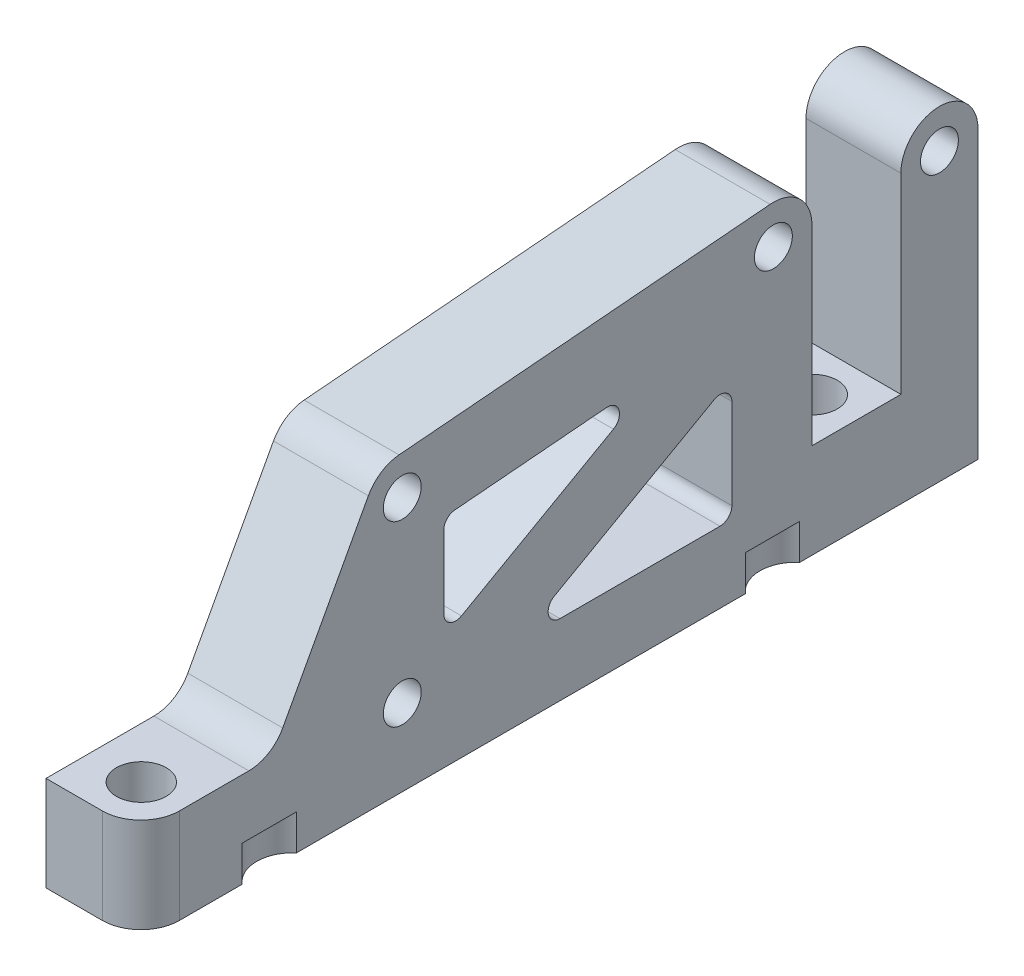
ISO-10303-21;
HEADER;
FILE_DESCRIPTION(('STEP AP214'),'2;1');
FILE_NAME('part.step','',(''),(''),'','','');
FILE_SCHEMA(('AUTOMOTIVE_DESIGN { 1 0 10303 214 1 1 1 1 }'));
ENDSEC;
DATA;
#1=APPLICATION_CONTEXT('core data for automotive mechanical design processes');
#2=APPLICATION_PROTOCOL_DEFINITION('international standard','automotive_design',2000,#1);
#3=PRODUCT_CONTEXT('',#1,'mechanical');
#4=PRODUCT('Part','Part','',(#3));
#5=PRODUCT_RELATED_PRODUCT_CATEGORY('part','',(#4));
#6=PRODUCT_DEFINITION_FORMATION('','',#4);
#7=PRODUCT_DEFINITION_CONTEXT('part definition',#1,'design');
#8=PRODUCT_DEFINITION('design','',#6,#7);
#9=PRODUCT_DEFINITION_SHAPE('','',#8);
#10=(LENGTH_UNIT() NAMED_UNIT(*) SI_UNIT(.MILLI.,.METRE.));
#11=(NAMED_UNIT(*) PLANE_ANGLE_UNIT() SI_UNIT($,.RADIAN.));
#12=(NAMED_UNIT(*) SI_UNIT($,.STERADIAN.) SOLID_ANGLE_UNIT());
#13=UNCERTAINTY_MEASURE_WITH_UNIT(LENGTH_MEASURE(1.E-05),#10,'distance_accuracy_value','');
#14=(GEOMETRIC_REPRESENTATION_CONTEXT(3) GLOBAL_UNCERTAINTY_ASSIGNED_CONTEXT((#13)) GLOBAL_UNIT_ASSIGNED_CONTEXT((#10,
#11,#12)) REPRESENTATION_CONTEXT('',''));
#15=CARTESIAN_POINT('',(0.,0.,0.));
#16=DIRECTION('',(0.,0.,1.));
#17=DIRECTION('',(1.,0.,0.));
#18=AXIS2_PLACEMENT_3D('',#15,#16,#17);
#19=CARTESIAN_POINT('',(32.0000000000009,140.15,654.715728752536));
#20=DIRECTION('',(-1.,0.,0.));
#21=DIRECTION('',(0.,0.,-1.));
#22=AXIS2_PLACEMENT_3D('',#19,#20,#21);
#23=PLANE('',#22);
#24=DIRECTION('',(0.,0.,1.));
#25=VECTOR('',#24,1.);
#26=CARTESIAN_POINT('',(32.0000000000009,122.,690.512606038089));
#27=LINE('',#26,#25);
#28=CARTESIAN_POINT('',(32.0000000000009,122.,673.215728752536));
#29=VERTEX_POINT('',#28);
#30=CARTESIAN_POINT('',(32.0000000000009,122.,686.705012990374));
#31=VERTEX_POINT('',#30);
#32=EDGE_CURVE('E454',#29,#31,#27,.T.);
#33=ORIENTED_EDGE('',*,*,#32,.T.);
#34=CARTESIAN_POINT('',(32.0000000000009,123.,686.705012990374));
#35=DIRECTION('',(1.,0.,0.));
#36=DIRECTION('',(0.,0.,-1.));
#37=AXIS2_PLACEMENT_3D('',#34,#35,#36);
#38=CIRCLE('',#37,1.);
#39=CARTESIAN_POINT('',(32.0000000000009,123.870949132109,687.196386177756));
#40=VERTEX_POINT('',#39);
#41=EDGE_CURVE('E437',#40,#31,#38,.T.);
#42=ORIENTED_EDGE('',*,*,#41,.F.);
#43=DIRECTION('',(0.,0.491373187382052,-0.870949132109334));
#44=VECTOR('',#43,1.);
#45=CARTESIAN_POINT('',(32.0000000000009,132.322755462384,672.215728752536));
#46=LINE('',#45,#44);
#47=CARTESIAN_POINT('',(32.0000000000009,131.481350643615,673.707101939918));
#48=VERTEX_POINT('',#47);
#49=EDGE_CURVE('E459',#40,#48,#46,.T.);
#50=ORIENTED_EDGE('',*,*,#49,.T.);
#51=CARTESIAN_POINT('',(32.0000000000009,130.610401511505,673.215728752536));
#52=DIRECTION('',(1.,0.,0.));
#53=DIRECTION('',(0.,0.,-1.));
#54=AXIS2_PLACEMENT_3D('',#51,#52,#53);
#55=CIRCLE('',#54,1.);
#56=CARTESIAN_POINT('',(32.0000000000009,130.610401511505,672.215728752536));
#57=VERTEX_POINT('',#56);
#58=EDGE_CURVE('E431',#57,#48,#55,.T.);
#59=ORIENTED_EDGE('',*,*,#58,.F.);
#60=DIRECTION('',(0.,-1.,0.));
#61=VECTOR('',#60,1.);
#62=CARTESIAN_POINT('',(32.0000000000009,122.,672.215728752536));
#63=LINE('',#62,#61);
#64=CARTESIAN_POINT('',(32.0000000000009,123.,672.215728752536));
#65=VERTEX_POINT('',#64);
#66=EDGE_CURVE('E449',#57,#65,#63,.T.);
#67=ORIENTED_EDGE('',*,*,#66,.T.);
#68=CARTESIAN_POINT('',(32.0000000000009,123.,673.215728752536));
#69=DIRECTION('',(1.,0.,0.));
#70=DIRECTION('',(0.,0.,-1.));
#71=AXIS2_PLACEMENT_3D('',#68,#69,#70);
#72=CIRCLE('',#71,1.);
#73=EDGE_CURVE('E49',#29,#65,#72,.T.);
#74=ORIENTED_EDGE('',*,*,#73,.F.);
#75=EDGE_LOOP('',(#33,#42,#50,#59,#67,#74));
#76=FACE_BOUND('',#75,.T.);
#77=DIRECTION('',(0.,1.,0.));
#78=VECTOR('',#77,1.);
#79=CARTESIAN_POINT('',(32.0000000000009,134.283940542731,696.500000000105));
#80=LINE('',#79,#78);
#81=CARTESIAN_POINT('',(32.0000000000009,127.223414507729,696.500000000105));
#82=VERTEX_POINT('',#81);
#83=CARTESIAN_POINT('',(32.0000000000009,133.365066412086,696.500000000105));
#84=VERTEX_POINT('',#83);
#85=EDGE_CURVE('E457',#82,#84,#80,.T.);
#86=ORIENTED_EDGE('',*,*,#85,.T.);
#87=CARTESIAN_POINT('',(32.0000000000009,133.365066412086,695.500000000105));
#88=DIRECTION('',(1.,0.,0.));
#89=DIRECTION('',(0.,0.,-1.));
#90=AXIS2_PLACEMENT_3D('',#87,#88,#89);
#91=CIRCLE('',#90,1.);
#92=CARTESIAN_POINT('',(32.0000000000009,134.36149795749,695.584404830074));
#93=VERTEX_POINT('',#92);
#94=EDGE_CURVE('E419',#93,#84,#91,.T.);
#95=ORIENTED_EDGE('',*,*,#94,.F.);
#96=DIRECTION('',(0.,0.0844048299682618,-0.996431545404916));
#97=VECTOR('',#96,1.);
#98=CARTESIAN_POINT('',(32.0000000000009,135.833816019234,678.203122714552));
#99=LINE('',#98,#97);
#100=CARTESIAN_POINT('',(32.0000000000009,135.446523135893,682.775264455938));
#101=VERTEX_POINT('',#100);
#102=EDGE_CURVE('E474',#93,#101,#99,.T.);
#103=ORIENTED_EDGE('',*,*,#102,.T.);
#104=CARTESIAN_POINT('',(32.0000000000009,134.450091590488,682.69085962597));
#105=DIRECTION('',(1.,0.,0.));
#106=DIRECTION('',(0.,0.,-1.));
#107=AXIS2_PLACEMENT_3D('',#104,#105,#106);
#108=CIRCLE('',#107,1.);
#109=CARTESIAN_POINT('',(32.0000000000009,133.579142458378,682.199486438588));
#110=VERTEX_POINT('',#109);
#111=EDGE_CURVE('E413',#110,#101,#108,.T.);
#112=ORIENTED_EDGE('',*,*,#111,.F.);
#113=DIRECTION('',(0.,-0.49137318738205,0.870949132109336));
#114=VECTOR('',#113,1.);
#115=CARTESIAN_POINT('',(32.0000000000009,125.51106055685,696.500000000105));
#116=LINE('',#115,#114);
#117=CARTESIAN_POINT('',(32.0000000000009,126.35246537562,695.008626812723));
#118=VERTEX_POINT('',#117);
#119=EDGE_CURVE('E453',#110,#118,#116,.T.);
#120=ORIENTED_EDGE('',*,*,#119,.T.);
#121=CARTESIAN_POINT('',(32.0000000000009,127.223414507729,695.500000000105));
#122=DIRECTION('',(1.,0.,0.));
#123=DIRECTION('',(0.,0.,-1.));
#124=AXIS2_PLACEMENT_3D('',#121,#122,#123);
#125=CIRCLE('',#124,1.);
#126=EDGE_CURVE('E425',#82,#118,#125,.T.);
#127=ORIENTED_EDGE('',*,*,#126,.F.);
#128=EDGE_LOOP('',(#86,#95,#103,#112,#120,#127));
#129=FACE_BOUND('',#128,.T.);
#130=DIRECTION('',(0.,0.,1.));
#131=VECTOR('',#130,1.);
#132=CARTESIAN_POINT('',(32.0000000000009,116.,651.465728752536));
#133=LINE('',#132,#131);
#134=CARTESIAN_POINT('',(32.0000000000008,116.,713.50056694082));
#135=VERTEX_POINT('',#134);
#136=CARTESIAN_POINT('',(32.0000000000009,116.,718.78427124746));
#137=VERTEX_POINT('',#136);
#138=EDGE_CURVE('E243',#135,#137,#133,.T.);
#139=ORIENTED_EDGE('',*,*,#138,.F.);
#140=DIRECTION('',(0.,1.,0.));
#141=VECTOR('',#140,1.);
#142=CARTESIAN_POINT('',(32.0000000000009,116.,713.50056694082));
#143=LINE('',#142,#141);
#144=CARTESIAN_POINT('',(32.0000000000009,119.,713.50056694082));
#145=VERTEX_POINT('',#144);
#146=EDGE_CURVE('E253',#145,#135,#143,.F.);
#147=ORIENTED_EDGE('',*,*,#146,.F.);
#148=DIRECTION('',(0.,0.,1.));
#149=VECTOR('',#148,1.);
#150=CARTESIAN_POINT('',(32.0000000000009,119.,654.715728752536));
#151=LINE('',#150,#149);
#152=CARTESIAN_POINT('',(32.0000000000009,119.,708.925839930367));
#153=VERTEX_POINT('',#152);
#154=EDGE_CURVE('E351',#153,#145,#151,.T.);
#155=ORIENTED_EDGE('',*,*,#154,.F.);
#156=DIRECTION('',(0.,1.,0.));
#157=VECTOR('',#156,1.);
#158=CARTESIAN_POINT('',(32.0000000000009,116.,708.925839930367));
#159=LINE('',#158,#157);
#160=CARTESIAN_POINT('',(32.0000000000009,116.,708.925839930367));
#161=VERTEX_POINT('',#160);
#162=EDGE_CURVE('E258',#161,#153,#159,.T.);
#163=ORIENTED_EDGE('',*,*,#162,.F.);
#164=CARTESIAN_POINT('',(32.0000000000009,116.,671.074160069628));
#165=VERTEX_POINT('',#164);
#166=EDGE_CURVE('E245',#165,#161,#133,.T.);
#167=ORIENTED_EDGE('',*,*,#166,.F.);
#168=DIRECTION('',(0.,1.,0.));
#169=VECTOR('',#168,1.);
#170=CARTESIAN_POINT('',(32.0000000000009,116.,671.074160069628));
#171=LINE('',#170,#169);
#172=CARTESIAN_POINT('',(32.0000000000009,119.,671.074160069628));
#173=VERTEX_POINT('',#172);
#174=EDGE_CURVE('E488',#173,#165,#171,.F.);
#175=ORIENTED_EDGE('',*,*,#174,.F.);
#176=DIRECTION('',(0.,0.,1.));
#177=VECTOR('',#176,1.);
#178=CARTESIAN_POINT('',(32.0000000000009,119.,654.715728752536));
#179=LINE('',#178,#177);
#180=CARTESIAN_POINT('',(32.0000000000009,119.,666.499433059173));
#181=VERTEX_POINT('',#180);
#182=EDGE_CURVE('E361',#181,#173,#179,.T.);
#183=ORIENTED_EDGE('',*,*,#182,.F.);
#184=DIRECTION('',(0.,1.,0.));
#185=VECTOR('',#184,1.);
#186=CARTESIAN_POINT('',(32.0000000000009,116.,666.499433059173));
#187=LINE('',#186,#185);
#188=CARTESIAN_POINT('',(32.0000000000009,116.,666.499433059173));
#189=VERTEX_POINT('',#188);
#190=EDGE_CURVE('E491',#189,#181,#187,.T.);
#191=ORIENTED_EDGE('',*,*,#190,.F.);
#192=CARTESIAN_POINT('',(32.0000000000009,116.,651.465728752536));
#193=VERTEX_POINT('',#192);
#194=EDGE_CURVE('E268',#193,#189,#133,.T.);
#195=ORIENTED_EDGE('',*,*,#194,.F.);
#196=DIRECTION('',(0.,-1.,0.));
#197=VECTOR('',#196,1.);
#198=CARTESIAN_POINT('',(32.0000000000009,140.15,651.465728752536));
#199=LINE('',#198,#197);
#200=CARTESIAN_POINT('',(32.0000000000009,140.15,651.465728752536));
#201=VERTEX_POINT('',#200);
#202=EDGE_CURVE('E266',#201,#193,#199,.T.);
#203=ORIENTED_EDGE('',*,*,#202,.F.);
#204=CARTESIAN_POINT('',(32.0000000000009,140.15,654.715728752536));
#205=DIRECTION('',(-1.,0.,0.));
#206=DIRECTION('',(0.,0.,-1.));
#207=AXIS2_PLACEMENT_3D('',#204,#205,#206);
#208=CIRCLE('',#207,3.24999999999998);
#209=CARTESIAN_POINT('',(32.0000000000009,140.15,657.965728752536));
#210=VERTEX_POINT('',#209);
#211=EDGE_CURVE('E270',#210,#201,#208,.T.);
#212=ORIENTED_EDGE('',*,*,#211,.F.);
#213=DIRECTION('',(0.,1.,0.));
#214=VECTOR('',#213,1.);
#215=CARTESIAN_POINT('',(32.0000000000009,140.15,657.965728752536));
#216=LINE('',#215,#214);
#217=CARTESIAN_POINT('',(32.0000000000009,124.,657.965728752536));
#218=VERTEX_POINT('',#217);
#219=EDGE_CURVE('E296',#218,#210,#216,.T.);
#220=ORIENTED_EDGE('',*,*,#219,.F.);
#221=DIRECTION('',(0.,0.,-1.));
#222=VECTOR('',#221,1.);
#223=CARTESIAN_POINT('',(32.0000000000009,124.,657.965728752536));
#224=LINE('',#223,#222);
#225=CARTESIAN_POINT('',(32.0000000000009,124.,665.465728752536));
#226=VERTEX_POINT('',#225);
#227=EDGE_CURVE('E293',#226,#218,#224,.T.);
#228=ORIENTED_EDGE('',*,*,#227,.F.);
#229=DIRECTION('',(0.,-1.,0.));
#230=VECTOR('',#229,1.);
#231=CARTESIAN_POINT('',(32.0000000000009,124.,665.465728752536));
#232=LINE('',#231,#230);
#233=CARTESIAN_POINT('',(32.0000000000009,140.15,665.465728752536));
#234=VERTEX_POINT('',#233);
#235=EDGE_CURVE('E290',#234,#226,#232,.T.);
#236=ORIENTED_EDGE('',*,*,#235,.F.);
#237=CARTESIAN_POINT('',(32.0000000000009,140.15,668.715728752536));
#238=DIRECTION('',(-1.,0.,0.));
#239=DIRECTION('',(0.,0.,-1.));
#240=AXIS2_PLACEMENT_3D('',#237,#238,#239);
#241=CIRCLE('',#240,3.24999999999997);
#242=CARTESIAN_POINT('',(32.0000000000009,143.388402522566,668.990044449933));
#243=VERTEX_POINT('',#242);
#244=EDGE_CURVE('E287',#243,#234,#241,.T.);
#245=ORIENTED_EDGE('',*,*,#244,.F.);
#246=DIRECTION('',(0.,0.0844048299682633,-0.996431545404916));
#247=VECTOR('',#246,1.);
#248=CARTESIAN_POINT('',(32.0000000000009,143.388402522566,668.990044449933));
#249=LINE('',#248,#247);
#250=CARTESIAN_POINT('',(32.0000000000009,140.738402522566,700.274315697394));
#251=VERTEX_POINT('',#250);
#252=EDGE_CURVE('E282',#251,#243,#249,.T.);
#253=ORIENTED_EDGE('',*,*,#252,.F.);
#254=CARTESIAN_POINT('',(32.0000000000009,137.5,699.999999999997));
#255=DIRECTION('',(1.,0.,0.));
#256=DIRECTION('',(0.,0.,-1.));
#257=AXIS2_PLACEMENT_3D('',#254,#255,#256);
#258=CIRCLE('',#257,3.25);
#259=CARTESIAN_POINT('',(32.0000000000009,139.046648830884,702.858387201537));
#260=VERTEX_POINT('',#259);
#261=EDGE_CURVE('E375',#260,#251,#258,.F.);
#262=ORIENTED_EDGE('',*,*,#261,.F.);
#263=DIRECTION('',(0.,0.87950375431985,-0.475891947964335));
#264=VECTOR('',#263,1.);
#265=CARTESIAN_POINT('',(32.0000000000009,124.,710.999999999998));
#266=LINE('',#265,#264);
#267=CARTESIAN_POINT('',(32.0000000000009,125.703351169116,710.078331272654));
#268=VERTEX_POINT('',#267);
#269=EDGE_CURVE('E278',#268,#260,#266,.T.);
#270=ORIENTED_EDGE('',*,*,#269,.F.);
#271=CARTESIAN_POINT('',(32.0000000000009,127.25,712.936718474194));
#272=DIRECTION('',(1.,0.,0.));
#273=DIRECTION('',(0.,0.,-1.));
#274=AXIS2_PLACEMENT_3D('',#271,#272,#273);
#275=CIRCLE('',#274,3.25);
#276=CARTESIAN_POINT('',(32.0000000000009,124.,712.936718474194));
#277=VERTEX_POINT('',#276);
#278=EDGE_CURVE('E381',#277,#268,#275,.T.);
#279=ORIENTED_EDGE('',*,*,#278,.F.);
#280=DIRECTION('',(0.,0.,-1.));
#281=VECTOR('',#280,1.);
#282=CARTESIAN_POINT('',(32.0000000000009,124.,710.999999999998));
#283=LINE('',#282,#281);
#284=CARTESIAN_POINT('',(32.0000000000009,124.,718.78427124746));
#285=VERTEX_POINT('',#284);
#286=EDGE_CURVE('E274',#285,#277,#283,.T.);
#287=ORIENTED_EDGE('',*,*,#286,.F.);
#288=DIRECTION('',(0.,1.,0.));
#289=VECTOR('',#288,1.);
#290=CARTESIAN_POINT('',(32.0000000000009,140.15,718.78427124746));
#291=LINE('',#290,#289);
#292=EDGE_CURVE('E265',#137,#285,#291,.T.);
#293=ORIENTED_EDGE('',*,*,#292,.F.);
#294=EDGE_LOOP('',(#139,#147,#155,#163,#167,#175,#183,#191,#195,#203,#212,#220,#228,#236,#245,
#253,#262,#270,#279,#287,#293));
#295=FACE_BOUND('',#294,.T.);
#296=CARTESIAN_POINT('',(32.0000000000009,140.15,654.715728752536));
#297=DIRECTION('',(-1.,0.,0.));
#298=DIRECTION('',(0.,0.,1.));
#299=AXIS2_PLACEMENT_3D('',#296,#297,#298);
#300=CIRCLE('',#299,1.60000000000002);
#301=CARTESIAN_POINT('',(32.0000000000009,140.15,656.315728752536));
#302=VERTEX_POINT('',#301);
#303=EDGE_CURVE('E304',#302,#302,#300,.T.);
#304=ORIENTED_EDGE('',*,*,#303,.T.);
#305=EDGE_LOOP('',(#304));
#306=FACE_BOUND('',#305,.T.);
#307=CARTESIAN_POINT('',(32.0000000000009,140.15,668.715728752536));
#308=DIRECTION('',(-1.,0.,0.));
#309=DIRECTION('',(0.,0.,1.));
#310=AXIS2_PLACEMENT_3D('',#307,#308,#309);
#311=CIRCLE('',#310,1.60000000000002);
#312=CARTESIAN_POINT('',(32.0000000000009,140.15,670.315728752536));
#313=VERTEX_POINT('',#312);
#314=EDGE_CURVE('E511',#313,#313,#311,.T.);
#315=ORIENTED_EDGE('',*,*,#314,.T.);
#316=EDGE_LOOP('',(#315));
#317=FACE_BOUND('',#316,.T.);
#318=CARTESIAN_POINT('',(32.0000000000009,137.5,699.999999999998));
#319=DIRECTION('',(-1.,0.,0.));
#320=DIRECTION('',(0.,0.,1.));
#321=AXIS2_PLACEMENT_3D('',#318,#319,#320);
#322=CIRCLE('',#321,1.60000000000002);
#323=CARTESIAN_POINT('',(32.0000000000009,137.5,701.599999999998));
#324=VERTEX_POINT('',#323);
#325=EDGE_CURVE('E505',#324,#324,#322,.T.);
#326=ORIENTED_EDGE('',*,*,#325,.T.);
#327=EDGE_LOOP('',(#326));
#328=FACE_BOUND('',#327,.T.);
#329=CARTESIAN_POINT('',(32.0000000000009,122.5,699.999999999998));
#330=DIRECTION('',(-1.,0.,0.));
#331=DIRECTION('',(0.,0.,1.));
#332=AXIS2_PLACEMENT_3D('',#329,#330,#331);
#333=CIRCLE('',#332,1.60000000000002);
#334=CARTESIAN_POINT('',(32.0000000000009,122.5,701.599999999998));
#335=VERTEX_POINT('',#334);
#336=EDGE_CURVE('E499',#335,#335,#333,.T.);
#337=ORIENTED_EDGE('',*,*,#336,.T.);
#338=EDGE_LOOP('',(#337));
#339=FACE_BOUND('',#338,.T.);
#340=ADVANCED_FACE('F41',(#76,#129,#295,#306,#317,#328,#339),#23,.F.);
#341=CARTESIAN_POINT('',(24.0000000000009,140.15,654.715728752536));
#342=DIRECTION('',(-1.,0.,0.));
#343=DIRECTION('',(0.,0.,-1.));
#344=AXIS2_PLACEMENT_3D('',#341,#342,#343);
#345=PLANE('',#344);
#346=DIRECTION('',(0.,0.491373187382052,-0.870949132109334));
#347=VECTOR('',#346,1.);
#348=CARTESIAN_POINT('',(24.0000000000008,132.322755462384,672.215728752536));
#349=LINE('',#348,#347);
#350=CARTESIAN_POINT('',(24.0000000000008,123.870949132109,687.196386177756));
#351=VERTEX_POINT('',#350);
#352=CARTESIAN_POINT('',(24.0000000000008,131.481350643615,673.707101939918));
#353=VERTEX_POINT('',#352);
#354=EDGE_CURVE('E463',#351,#353,#349,.T.);
#355=ORIENTED_EDGE('',*,*,#354,.F.);
#356=CARTESIAN_POINT('',(24.0000000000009,123.,686.705012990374));
#357=DIRECTION('',(1.,0.,0.));
#358=DIRECTION('',(0.,0.,-1.));
#359=AXIS2_PLACEMENT_3D('',#356,#357,#358);
#360=CIRCLE('',#359,1.);
#361=CARTESIAN_POINT('',(24.0000000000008,122.,686.705012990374));
#362=VERTEX_POINT('',#361);
#363=EDGE_CURVE('E439',#362,#351,#360,.F.);
#364=ORIENTED_EDGE('',*,*,#363,.F.);
#365=DIRECTION('',(0.,0.,1.));
#366=VECTOR('',#365,1.);
#367=CARTESIAN_POINT('',(24.0000000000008,122.,690.512606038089));
#368=LINE('',#367,#366);
#369=CARTESIAN_POINT('',(24.0000000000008,122.,673.215728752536));
#370=VERTEX_POINT('',#369);
#371=EDGE_CURVE('E466',#370,#362,#368,.T.);
#372=ORIENTED_EDGE('',*,*,#371,.F.);
#373=CARTESIAN_POINT('',(24.0000000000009,123.,673.215728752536));
#374=DIRECTION('',(1.,0.,0.));
#375=DIRECTION('',(0.,0.,-1.));
#376=AXIS2_PLACEMENT_3D('',#373,#374,#375);
#377=CIRCLE('',#376,1.);
#378=CARTESIAN_POINT('',(24.0000000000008,123.,672.215728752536));
#379=VERTEX_POINT('',#378);
#380=EDGE_CURVE('E11',#379,#370,#377,.F.);
#381=ORIENTED_EDGE('',*,*,#380,.F.);
#382=DIRECTION('',(0.,-1.,0.));
#383=VECTOR('',#382,1.);
#384=CARTESIAN_POINT('',(24.0000000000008,122.,672.215728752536));
#385=LINE('',#384,#383);
#386=CARTESIAN_POINT('',(24.0000000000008,130.610401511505,672.215728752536));
#387=VERTEX_POINT('',#386);
#388=EDGE_CURVE('E468',#387,#379,#385,.T.);
#389=ORIENTED_EDGE('',*,*,#388,.F.);
#390=CARTESIAN_POINT('',(24.0000000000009,130.610401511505,673.215728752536));
#391=DIRECTION('',(1.,0.,0.));
#392=DIRECTION('',(0.,0.,-1.));
#393=AXIS2_PLACEMENT_3D('',#390,#391,#392);
#394=CIRCLE('',#393,1.);
#395=EDGE_CURVE('E434',#353,#387,#394,.F.);
#396=ORIENTED_EDGE('',*,*,#395,.F.);
#397=EDGE_LOOP('',(#355,#364,#372,#381,#389,#396));
#398=FACE_BOUND('',#397,.T.);
#399=DIRECTION('',(0.,0.0844048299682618,-0.996431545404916));
#400=VECTOR('',#399,1.);
#401=CARTESIAN_POINT('',(24.0000000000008,135.833816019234,678.203122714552));
#402=LINE('',#401,#400);
#403=CARTESIAN_POINT('',(24.0000000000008,134.36149795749,695.584404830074));
#404=VERTEX_POINT('',#403);
#405=CARTESIAN_POINT('',(24.0000000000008,135.446523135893,682.775264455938));
#406=VERTEX_POINT('',#405);
#407=EDGE_CURVE('E250',#404,#406,#402,.T.);
#408=ORIENTED_EDGE('',*,*,#407,.F.);
#409=CARTESIAN_POINT('',(24.0000000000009,133.365066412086,695.500000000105));
#410=DIRECTION('',(1.,0.,0.));
#411=DIRECTION('',(0.,0.,-1.));
#412=AXIS2_PLACEMENT_3D('',#409,#410,#411);
#413=CIRCLE('',#412,1.);
#414=CARTESIAN_POINT('',(24.0000000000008,133.365066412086,696.500000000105));
#415=VERTEX_POINT('',#414);
#416=EDGE_CURVE('E422',#415,#404,#413,.F.);
#417=ORIENTED_EDGE('',*,*,#416,.F.);
#418=DIRECTION('',(0.,1.,0.));
#419=VECTOR('',#418,1.);
#420=CARTESIAN_POINT('',(24.0000000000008,134.283940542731,696.500000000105));
#421=LINE('',#420,#419);
#422=CARTESIAN_POINT('',(24.0000000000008,127.223414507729,696.500000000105));
#423=VERTEX_POINT('',#422);
#424=EDGE_CURVE('E473',#423,#415,#421,.T.);
#425=ORIENTED_EDGE('',*,*,#424,.F.);
#426=CARTESIAN_POINT('',(24.0000000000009,127.223414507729,695.500000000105));
#427=DIRECTION('',(1.,0.,0.));
#428=DIRECTION('',(0.,0.,-1.));
#429=AXIS2_PLACEMENT_3D('',#426,#427,#428);
#430=CIRCLE('',#429,1.);
#431=CARTESIAN_POINT('',(24.0000000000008,126.35246537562,695.008626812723));
#432=VERTEX_POINT('',#431);
#433=EDGE_CURVE('E428',#432,#423,#430,.F.);
#434=ORIENTED_EDGE('',*,*,#433,.F.);
#435=DIRECTION('',(0.,-0.49137318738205,0.870949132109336));
#436=VECTOR('',#435,1.);
#437=CARTESIAN_POINT('',(24.0000000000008,125.51106055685,696.500000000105));
#438=LINE('',#437,#436);
#439=CARTESIAN_POINT('',(24.0000000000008,133.579142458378,682.199486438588));
#440=VERTEX_POINT('',#439);
#441=EDGE_CURVE('E470',#440,#432,#438,.T.);
#442=ORIENTED_EDGE('',*,*,#441,.F.);
#443=CARTESIAN_POINT('',(24.0000000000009,134.450091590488,682.69085962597));
#444=DIRECTION('',(1.,0.,0.));
#445=DIRECTION('',(0.,0.,-1.));
#446=AXIS2_PLACEMENT_3D('',#443,#444,#445);
#447=CIRCLE('',#446,1.);
#448=EDGE_CURVE('E416',#406,#440,#447,.F.);
#449=ORIENTED_EDGE('',*,*,#448,.F.);
#450=EDGE_LOOP('',(#408,#417,#425,#434,#442,#449));
#451=FACE_BOUND('',#450,.T.);
#452=CARTESIAN_POINT('',(24.0000000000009,137.5,699.999999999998));
#453=DIRECTION('',(-1.,0.,0.));
#454=DIRECTION('',(0.,0.,1.));
#455=AXIS2_PLACEMENT_3D('',#452,#453,#454);
#456=CIRCLE('',#455,1.60000000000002);
#457=CARTESIAN_POINT('',(24.0000000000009,137.5,701.599999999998));
#458=VERTEX_POINT('',#457);
#459=EDGE_CURVE('E502',#458,#458,#456,.T.);
#460=ORIENTED_EDGE('',*,*,#459,.F.);
#461=EDGE_LOOP('',(#460));
#462=FACE_BOUND('',#461,.T.);
#463=CARTESIAN_POINT('',(24.0000000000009,140.15,654.715728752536));
#464=DIRECTION('',(-1.,0.,0.));
#465=DIRECTION('',(0.,0.,1.));
#466=AXIS2_PLACEMENT_3D('',#463,#464,#465);
#467=CIRCLE('',#466,1.60000000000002);
#468=CARTESIAN_POINT('',(24.0000000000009,140.15,656.315728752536));
#469=VERTEX_POINT('',#468);
#470=EDGE_CURVE('E514',#469,#469,#467,.T.);
#471=ORIENTED_EDGE('',*,*,#470,.F.);
#472=EDGE_LOOP('',(#471));
#473=FACE_BOUND('',#472,.T.);
#474=DIRECTION('',(0.,0.0844048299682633,-0.996431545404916));
#475=VECTOR('',#474,1.);
#476=CARTESIAN_POINT('',(24.0000000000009,143.388402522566,668.990044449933));
#477=LINE('',#476,#475);
#478=CARTESIAN_POINT('',(24.0000000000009,140.738402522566,700.274315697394));
#479=VERTEX_POINT('',#478);
#480=CARTESIAN_POINT('',(24.0000000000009,143.388402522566,668.990044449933));
#481=VERTEX_POINT('',#480);
#482=EDGE_CURVE('E319',#479,#481,#477,.T.);
#483=ORIENTED_EDGE('',*,*,#482,.T.);
#484=CARTESIAN_POINT('',(24.0000000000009,140.15,668.715728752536));
#485=DIRECTION('',(-1.,0.,0.));
#486=DIRECTION('',(0.,0.,-1.));
#487=AXIS2_PLACEMENT_3D('',#484,#485,#486);
#488=CIRCLE('',#487,3.24999999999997);
#489=CARTESIAN_POINT('',(24.0000000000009,140.15,665.465728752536));
#490=VERTEX_POINT('',#489);
#491=EDGE_CURVE('E322',#481,#490,#488,.T.);
#492=ORIENTED_EDGE('',*,*,#491,.T.);
#493=DIRECTION('',(0.,-1.,0.));
#494=VECTOR('',#493,1.);
#495=CARTESIAN_POINT('',(24.0000000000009,124.,665.465728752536));
#496=LINE('',#495,#494);
#497=CARTESIAN_POINT('',(24.0000000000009,124.,665.465728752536));
#498=VERTEX_POINT('',#497);
#499=EDGE_CURVE('E325',#490,#498,#496,.T.);
#500=ORIENTED_EDGE('',*,*,#499,.T.);
#501=DIRECTION('',(0.,0.,-1.));
#502=VECTOR('',#501,1.);
#503=CARTESIAN_POINT('',(24.0000000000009,124.,657.965728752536));
#504=LINE('',#503,#502);
#505=CARTESIAN_POINT('',(24.0000000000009,124.,657.965728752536));
#506=VERTEX_POINT('',#505);
#507=EDGE_CURVE('E328',#498,#506,#504,.T.);
#508=ORIENTED_EDGE('',*,*,#507,.T.);
#509=DIRECTION('',(0.,1.,0.));
#510=VECTOR('',#509,1.);
#511=CARTESIAN_POINT('',(24.0000000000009,140.15,657.965728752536));
#512=LINE('',#511,#510);
#513=CARTESIAN_POINT('',(24.0000000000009,140.15,657.965728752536));
#514=VERTEX_POINT('',#513);
#515=EDGE_CURVE('E331',#506,#514,#512,.T.);
#516=ORIENTED_EDGE('',*,*,#515,.T.);
#517=CARTESIAN_POINT('',(24.0000000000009,140.15,654.715728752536));
#518=DIRECTION('',(-1.,0.,0.));
#519=DIRECTION('',(0.,0.,-1.));
#520=AXIS2_PLACEMENT_3D('',#517,#518,#519);
#521=CIRCLE('',#520,3.24999999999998);
#522=CARTESIAN_POINT('',(24.0000000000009,140.15,651.465728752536));
#523=VERTEX_POINT('',#522);
#524=EDGE_CURVE('E300',#514,#523,#521,.T.);
#525=ORIENTED_EDGE('',*,*,#524,.T.);
#526=DIRECTION('',(0.,-1.,0.));
#527=VECTOR('',#526,1.);
#528=CARTESIAN_POINT('',(24.0000000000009,140.15,651.465728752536));
#529=LINE('',#528,#527);
#530=CARTESIAN_POINT('',(24.0000000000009,116.,651.465728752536));
#531=VERTEX_POINT('',#530);
#532=EDGE_CURVE('E303',#523,#531,#529,.T.);
#533=ORIENTED_EDGE('',*,*,#532,.T.);
#534=DIRECTION('',(0.,0.,1.));
#535=VECTOR('',#534,1.);
#536=CARTESIAN_POINT('',(24.0000000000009,116.,651.465728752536));
#537=LINE('',#536,#535);
#538=CARTESIAN_POINT('',(24.0000000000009,116.,722.03427124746));
#539=VERTEX_POINT('',#538);
#540=EDGE_CURVE('E307',#531,#539,#537,.T.);
#541=ORIENTED_EDGE('',*,*,#540,.T.);
#542=DIRECTION('',(0.,1.,0.));
#543=VECTOR('',#542,1.);
#544=CARTESIAN_POINT('',(24.0000000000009,124.,722.03427124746));
#545=LINE('',#544,#543);
#546=CARTESIAN_POINT('',(24.0000000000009,124.,722.03427124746));
#547=VERTEX_POINT('',#546);
#548=EDGE_CURVE('E310',#539,#547,#545,.T.);
#549=ORIENTED_EDGE('',*,*,#548,.T.);
#550=DIRECTION('',(0.,0.,-1.));
#551=VECTOR('',#550,1.);
#552=CARTESIAN_POINT('',(24.0000000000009,124.,710.999999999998));
#553=LINE('',#552,#551);
#554=CARTESIAN_POINT('',(24.0000000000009,124.,712.936718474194));
#555=VERTEX_POINT('',#554);
#556=EDGE_CURVE('E313',#547,#555,#553,.T.);
#557=ORIENTED_EDGE('',*,*,#556,.T.);
#558=CARTESIAN_POINT('',(24.0000000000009,127.25,712.936718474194));
#559=DIRECTION('',(1.,0.,0.));
#560=DIRECTION('',(0.,0.,-1.));
#561=AXIS2_PLACEMENT_3D('',#558,#559,#560);
#562=CIRCLE('',#561,3.25);
#563=CARTESIAN_POINT('',(24.0000000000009,125.703351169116,710.078331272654));
#564=VERTEX_POINT('',#563);
#565=EDGE_CURVE('E378',#564,#555,#562,.F.);
#566=ORIENTED_EDGE('',*,*,#565,.F.);
#567=DIRECTION('',(0.,0.87950375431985,-0.475891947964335));
#568=VECTOR('',#567,1.);
#569=CARTESIAN_POINT('',(24.0000000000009,124.,710.999999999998));
#570=LINE('',#569,#568);
#571=CARTESIAN_POINT('',(24.0000000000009,139.046648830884,702.858387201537));
#572=VERTEX_POINT('',#571);
#573=EDGE_CURVE('E316',#564,#572,#570,.T.);
#574=ORIENTED_EDGE('',*,*,#573,.T.);
#575=CARTESIAN_POINT('',(24.0000000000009,137.5,699.999999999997));
#576=DIRECTION('',(1.,0.,0.));
#577=DIRECTION('',(0.,0.,-1.));
#578=AXIS2_PLACEMENT_3D('',#575,#576,#577);
#579=CIRCLE('',#578,3.25);
#580=EDGE_CURVE('E372',#479,#572,#579,.T.);
#581=ORIENTED_EDGE('',*,*,#580,.F.);
#582=EDGE_LOOP('',(#483,#492,#500,#508,#516,#525,#533,#541,#549,#557,#566,#574,#581));
#583=FACE_BOUND('',#582,.T.);
#584=CARTESIAN_POINT('',(24.0000000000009,140.15,668.715728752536));
#585=DIRECTION('',(-1.,0.,0.));
#586=DIRECTION('',(0.,0.,1.));
#587=AXIS2_PLACEMENT_3D('',#584,#585,#586);
#588=CIRCLE('',#587,1.60000000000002);
#589=CARTESIAN_POINT('',(24.0000000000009,140.15,670.315728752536));
#590=VERTEX_POINT('',#589);
#591=EDGE_CURVE('E508',#590,#590,#588,.T.);
#592=ORIENTED_EDGE('',*,*,#591,.F.);
#593=EDGE_LOOP('',(#592));
#594=FACE_BOUND('',#593,.T.);
#595=CARTESIAN_POINT('',(24.0000000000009,122.5,699.999999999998));
#596=DIRECTION('',(-1.,0.,0.));
#597=DIRECTION('',(0.,0.,1.));
#598=AXIS2_PLACEMENT_3D('',#595,#596,#597);
#599=CIRCLE('',#598,1.60000000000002);
#600=CARTESIAN_POINT('',(24.0000000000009,122.5,701.599999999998));
#601=VERTEX_POINT('',#600);
#602=EDGE_CURVE('E359',#601,#601,#599,.T.);
#603=ORIENTED_EDGE('',*,*,#602,.F.);
#604=EDGE_LOOP('',(#603));
#605=FACE_BOUND('',#604,.T.);
#606=ADVANCED_FACE('F533',(#398,#451,#462,#473,#583,#594,#605),#345,.T.);
#607=CARTESIAN_POINT('',(32.0000000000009,140.15,654.715728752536));
#608=DIRECTION('',(-1.,0.,0.));
#609=DIRECTION('',(0.,0.,-1.));
#610=AXIS2_PLACEMENT_3D('',#607,#608,#609);
#611=CYLINDRICAL_SURFACE('',#610,3.24999999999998);
#612=ORIENTED_EDGE('',*,*,#524,.F.);
#613=DIRECTION('',(-1.,0.,0.));
#614=VECTOR('',#613,1.);
#615=CARTESIAN_POINT('',(32.0000000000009,140.15,657.965728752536));
#616=LINE('',#615,#614);
#617=EDGE_CURVE('E299',#210,#514,#616,.T.);
#618=ORIENTED_EDGE('',*,*,#617,.F.);
#619=ORIENTED_EDGE('',*,*,#211,.T.);
#620=DIRECTION('',(-1.,0.,0.));
#621=VECTOR('',#620,1.);
#622=CARTESIAN_POINT('',(32.0000000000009,140.15,651.465728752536));
#623=LINE('',#622,#621);
#624=EDGE_CURVE('E349',#201,#523,#623,.T.);
#625=ORIENTED_EDGE('',*,*,#624,.T.);
#626=EDGE_LOOP('',(#612,#618,#619,#625));
#627=FACE_BOUND('',#626,.T.);
#628=ADVANCED_FACE('F526',(#627),#611,.T.);
#629=CARTESIAN_POINT('',(32.0000000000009,140.15,651.465728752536));
#630=DIRECTION('',(0.,0.,1.));
#631=DIRECTION('',(-1.,0.,0.));
#632=AXIS2_PLACEMENT_3D('',#629,#630,#631);
#633=PLANE('',#632);
#634=ORIENTED_EDGE('',*,*,#532,.F.);
#635=ORIENTED_EDGE('',*,*,#624,.F.);
#636=ORIENTED_EDGE('',*,*,#202,.T.);
#637=DIRECTION('',(-1.,0.,0.));
#638=VECTOR('',#637,1.);
#639=CARTESIAN_POINT('',(32.0000000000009,116.,651.465728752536));
#640=LINE('',#639,#638);
#641=EDGE_CURVE('E347',#193,#531,#640,.T.);
#642=ORIENTED_EDGE('',*,*,#641,.T.);
#643=EDGE_LOOP('',(#634,#635,#636,#642));
#644=FACE_BOUND('',#643,.T.);
#645=ADVANCED_FACE('F530',(#644),#633,.F.);
#646=CARTESIAN_POINT('',(32.0000000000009,116.,651.465728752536));
#647=DIRECTION('',(0.,1.,0.));
#648=DIRECTION('',(0.,0.,1.));
#649=AXIS2_PLACEMENT_3D('',#646,#647,#648);
#650=PLANE('',#649);
#651=CARTESIAN_POINT('',(28.2842712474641,116.,718.284271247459));
#652=DIRECTION('',(0.,1.,0.));
#653=DIRECTION('',(0.,0.,-1.));
#654=AXIS2_PLACEMENT_3D('',#651,#652,#653);
#655=CIRCLE('',#654,2.1);
#656=CARTESIAN_POINT('',(28.2842712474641,116.,716.184271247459));
#657=VERTEX_POINT('',#656);
#658=EDGE_CURVE('E356',#657,#657,#655,.T.);
#659=ORIENTED_EDGE('',*,*,#658,.T.);
#660=EDGE_LOOP('',(#659));
#661=FACE_BOUND('',#660,.T.);
#662=CARTESIAN_POINT('',(28.2842712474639,116.,661.715728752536));
#663=DIRECTION('',(0.,1.,0.));
#664=DIRECTION('',(0.,0.,-1.));
#665=AXIS2_PLACEMENT_3D('',#662,#663,#664);
#666=CIRCLE('',#665,2.10000000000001);
#667=CARTESIAN_POINT('',(28.2842712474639,116.,659.615728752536));
#668=VERTEX_POINT('',#667);
#669=EDGE_CURVE('E494',#668,#668,#666,.T.);
#670=ORIENTED_EDGE('',*,*,#669,.T.);
#671=EDGE_LOOP('',(#670));
#672=FACE_BOUND('',#671,.T.);
#673=DIRECTION('',(-1.,0.,0.));
#674=VECTOR('',#673,1.);
#675=CARTESIAN_POINT('',(32.0000000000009,116.,722.03427124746));
#676=LINE('',#675,#674);
#677=CARTESIAN_POINT('',(28.7500000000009,116.,722.03427124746));
#678=VERTEX_POINT('',#677);
#679=EDGE_CURVE('E345',#678,#539,#676,.T.);
#680=ORIENTED_EDGE('',*,*,#679,.T.);
#681=ORIENTED_EDGE('',*,*,#540,.F.);
#682=ORIENTED_EDGE('',*,*,#641,.F.);
#683=ORIENTED_EDGE('',*,*,#194,.T.);
#684=CARTESIAN_POINT('',(33.9411254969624,116.,668.7867965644));
#685=DIRECTION('',(0.,-1.,0.));
#686=DIRECTION('',(1.,0.,0.));
#687=AXIS2_PLACEMENT_3D('',#684,#685,#686);
#688=CIRCLE('',#687,3.);
#689=EDGE_CURVE('E259',#165,#189,#688,.T.);
#690=ORIENTED_EDGE('',*,*,#689,.F.);
#691=ORIENTED_EDGE('',*,*,#166,.T.);
#692=CARTESIAN_POINT('',(33.9411254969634,116.,711.213203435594));
#693=DIRECTION('',(0.,-1.,0.));
#694=DIRECTION('',(1.,0.,0.));
#695=AXIS2_PLACEMENT_3D('',#692,#693,#694);
#696=CIRCLE('',#695,3.);
#697=EDGE_CURVE('E238',#135,#161,#696,.T.);
#698=ORIENTED_EDGE('',*,*,#697,.F.);
#699=ORIENTED_EDGE('',*,*,#138,.T.);
#700=CARTESIAN_POINT('',(28.7500000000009,116.,718.78427124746));
#701=DIRECTION('',(0.,-1.,0.));
#702=DIRECTION('',(0.,0.,1.));
#703=AXIS2_PLACEMENT_3D('',#700,#701,#702);
#704=CIRCLE('',#703,3.25);
#705=EDGE_CURVE('E389',#678,#137,#704,.F.);
#706=ORIENTED_EDGE('',*,*,#705,.F.);
#707=EDGE_LOOP('',(#680,#681,#682,#683,#690,#691,#698,#699,#706));
#708=FACE_BOUND('',#707,.T.);
#709=ADVANCED_FACE('F240',(#661,#672,#708),#650,.F.);
#710=CARTESIAN_POINT('',(32.0000000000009,124.,722.03427124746));
#711=DIRECTION('',(0.,0.,-1.));
#712=DIRECTION('',(1.,0.,0.));
#713=AXIS2_PLACEMENT_3D('',#710,#711,#712);
#714=PLANE('',#713);
#715=DIRECTION('',(-1.,0.,0.));
#716=VECTOR('',#715,1.);
#717=CARTESIAN_POINT('',(32.0000000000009,124.,722.03427124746));
#718=LINE('',#717,#716);
#719=CARTESIAN_POINT('',(28.7500000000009,124.,722.03427124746));
#720=VERTEX_POINT('',#719);
#721=EDGE_CURVE('E343',#720,#547,#718,.T.);
#722=ORIENTED_EDGE('',*,*,#721,.T.);
#723=ORIENTED_EDGE('',*,*,#548,.F.);
#724=ORIENTED_EDGE('',*,*,#679,.F.);
#725=DIRECTION('',(0.,1.,0.));
#726=VECTOR('',#725,1.);
#727=CARTESIAN_POINT('',(28.7500000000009,124.,722.03427124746));
#728=LINE('',#727,#726);
#729=EDGE_CURVE('E387',#720,#678,#728,.F.);
#730=ORIENTED_EDGE('',*,*,#729,.F.);
#731=EDGE_LOOP('',(#722,#723,#724,#730));
#732=FACE_BOUND('',#731,.T.);
#733=ADVANCED_FACE('F571',(#732),#714,.F.);
#734=CARTESIAN_POINT('',(32.0000000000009,124.,710.999999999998));
#735=DIRECTION('',(0.,-1.,0.));
#736=DIRECTION('',(-1.,0.,0.));
#737=AXIS2_PLACEMENT_3D('',#734,#735,#736);
#738=PLANE('',#737);
#739=CARTESIAN_POINT('',(28.2842712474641,124.,718.284271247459));
#740=DIRECTION('',(0.,1.,0.));
#741=DIRECTION('',(-1.,0.,0.));
#742=AXIS2_PLACEMENT_3D('',#739,#740,#741);
#743=CIRCLE('',#742,2.1);
#744=CARTESIAN_POINT('',(26.1842712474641,124.,718.284271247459));
#745=VERTEX_POINT('',#744);
#746=EDGE_CURVE('E355',#745,#745,#743,.T.);
#747=ORIENTED_EDGE('',*,*,#746,.F.);
#748=EDGE_LOOP('',(#747));
#749=FACE_BOUND('',#748,.T.);
#750=ORIENTED_EDGE('',*,*,#286,.T.);
#751=DIRECTION('',(-1.,0.,0.));
#752=VECTOR('',#751,1.);
#753=CARTESIAN_POINT('',(32.0000000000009,124.,712.936718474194));
#754=LINE('',#753,#752);
#755=EDGE_CURVE('E368',#555,#277,#754,.F.);
#756=ORIENTED_EDGE('',*,*,#755,.F.);
#757=ORIENTED_EDGE('',*,*,#556,.F.);
#758=ORIENTED_EDGE('',*,*,#721,.F.);
#759=CARTESIAN_POINT('',(28.7500000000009,124.,718.78427124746));
#760=DIRECTION('',(0.,1.,0.));
#761=DIRECTION('',(-1.,0.,0.));
#762=AXIS2_PLACEMENT_3D('',#759,#760,#761);
#763=CIRCLE('',#762,3.25);
#764=EDGE_CURVE('E385',#285,#720,#763,.F.);
#765=ORIENTED_EDGE('',*,*,#764,.F.);
#766=EDGE_LOOP('',(#750,#756,#757,#758,#765));
#767=FACE_BOUND('',#766,.T.);
#768=ADVANCED_FACE('F566',(#749,#767),#738,.F.);
#769=CARTESIAN_POINT('',(32.0000000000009,124.,710.999999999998));
#770=DIRECTION('',(0.,-0.475891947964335,-0.87950375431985));
#771=DIRECTION('',(0.,0.87950375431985,-0.475891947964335));
#772=AXIS2_PLACEMENT_3D('',#769,#770,#771);
#773=PLANE('',#772);
#774=ORIENTED_EDGE('',*,*,#269,.T.);
#775=DIRECTION('',(-1.,0.,0.));
#776=VECTOR('',#775,1.);
#777=CARTESIAN_POINT('',(32.0000000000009,139.046648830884,702.858387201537));
#778=LINE('',#777,#776);
#779=EDGE_CURVE('E364',#572,#260,#778,.F.);
#780=ORIENTED_EDGE('',*,*,#779,.F.);
#781=ORIENTED_EDGE('',*,*,#573,.F.);
#782=DIRECTION('',(-1.,0.,0.));
#783=VECTOR('',#782,1.);
#784=CARTESIAN_POINT('',(24.0000000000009,125.703351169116,710.078331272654));
#785=LINE('',#784,#783);
#786=EDGE_CURVE('E366',#268,#564,#785,.T.);
#787=ORIENTED_EDGE('',*,*,#786,.F.);
#788=EDGE_LOOP('',(#774,#780,#781,#787));
#789=FACE_BOUND('',#788,.T.);
#790=ADVANCED_FACE('F561',(#789),#773,.F.);
#791=CARTESIAN_POINT('',(32.0000000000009,143.388402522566,668.990044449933));
#792=DIRECTION('',(0.,-0.996431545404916,-0.0844048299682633));
#793=DIRECTION('',(0.,0.0844048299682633,-0.996431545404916));
#794=AXIS2_PLACEMENT_3D('',#791,#792,#793);
#795=PLANE('',#794);
#796=ORIENTED_EDGE('',*,*,#252,.T.);
#797=DIRECTION('',(-1.,0.,0.));
#798=VECTOR('',#797,1.);
#799=CARTESIAN_POINT('',(32.0000000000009,143.388402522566,668.990044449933));
#800=LINE('',#799,#798);
#801=EDGE_CURVE('E341',#243,#481,#800,.T.);
#802=ORIENTED_EDGE('',*,*,#801,.T.);
#803=ORIENTED_EDGE('',*,*,#482,.F.);
#804=DIRECTION('',(-1.,0.,0.));
#805=VECTOR('',#804,1.);
#806=CARTESIAN_POINT('',(32.0000000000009,140.738402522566,700.274315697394));
#807=LINE('',#806,#805);
#808=EDGE_CURVE('E370',#251,#479,#807,.T.);
#809=ORIENTED_EDGE('',*,*,#808,.F.);
#810=EDGE_LOOP('',(#796,#802,#803,#809));
#811=FACE_BOUND('',#810,.T.);
#812=ADVANCED_FACE('F554',(#811),#795,.F.);
#813=CARTESIAN_POINT('',(32.0000000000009,140.15,668.715728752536));
#814=DIRECTION('',(-1.,0.,0.));
#815=DIRECTION('',(0.,0.,-1.));
#816=AXIS2_PLACEMENT_3D('',#813,#814,#815);
#817=CYLINDRICAL_SURFACE('',#816,3.24999999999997);
#818=ORIENTED_EDGE('',*,*,#491,.F.);
#819=ORIENTED_EDGE('',*,*,#801,.F.);
#820=ORIENTED_EDGE('',*,*,#244,.T.);
#821=DIRECTION('',(-1.,0.,0.));
#822=VECTOR('',#821,1.);
#823=CARTESIAN_POINT('',(32.0000000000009,140.15,665.465728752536));
#824=LINE('',#823,#822);
#825=EDGE_CURVE('E339',#234,#490,#824,.T.);
#826=ORIENTED_EDGE('',*,*,#825,.T.);
#827=EDGE_LOOP('',(#818,#819,#820,#826));
#828=FACE_BOUND('',#827,.T.);
#829=ADVANCED_FACE('F549',(#828),#817,.T.);
#830=CARTESIAN_POINT('',(32.0000000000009,124.,665.465728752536));
#831=DIRECTION('',(0.,0.,1.));
#832=DIRECTION('',(-1.,0.,0.));
#833=AXIS2_PLACEMENT_3D('',#830,#831,#832);
#834=PLANE('',#833);
#835=ORIENTED_EDGE('',*,*,#499,.F.);
#836=ORIENTED_EDGE('',*,*,#825,.F.);
#837=ORIENTED_EDGE('',*,*,#235,.T.);
#838=DIRECTION('',(-1.,0.,0.));
#839=VECTOR('',#838,1.);
#840=CARTESIAN_POINT('',(32.0000000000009,124.,665.465728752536));
#841=LINE('',#840,#839);
#842=EDGE_CURVE('E337',#226,#498,#841,.T.);
#843=ORIENTED_EDGE('',*,*,#842,.T.);
#844=EDGE_LOOP('',(#835,#836,#837,#843));
#845=FACE_BOUND('',#844,.T.);
#846=ADVANCED_FACE('F546',(#845),#834,.F.);
#847=CARTESIAN_POINT('',(32.0000000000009,124.,657.965728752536));
#848=DIRECTION('',(0.,-1.,0.));
#849=DIRECTION('',(-1.,0.,0.));
#850=AXIS2_PLACEMENT_3D('',#847,#848,#849);
#851=PLANE('',#850);
#852=CARTESIAN_POINT('',(28.2842712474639,124.,661.715728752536));
#853=DIRECTION('',(0.,1.,0.));
#854=DIRECTION('',(-1.,0.,0.));
#855=AXIS2_PLACEMENT_3D('',#852,#853,#854);
#856=CIRCLE('',#855,2.10000000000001);
#857=CARTESIAN_POINT('',(26.1842712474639,124.,661.715728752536));
#858=VERTEX_POINT('',#857);
#859=EDGE_CURVE('E352',#858,#858,#856,.T.);
#860=ORIENTED_EDGE('',*,*,#859,.F.);
#861=EDGE_LOOP('',(#860));
#862=FACE_BOUND('',#861,.T.);
#863=ORIENTED_EDGE('',*,*,#507,.F.);
#864=ORIENTED_EDGE('',*,*,#842,.F.);
#865=ORIENTED_EDGE('',*,*,#227,.T.);
#866=DIRECTION('',(-1.,0.,0.));
#867=VECTOR('',#866,1.);
#868=CARTESIAN_POINT('',(32.0000000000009,124.,657.965728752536));
#869=LINE('',#868,#867);
#870=EDGE_CURVE('E335',#218,#506,#869,.T.);
#871=ORIENTED_EDGE('',*,*,#870,.T.);
#872=EDGE_LOOP('',(#863,#864,#865,#871));
#873=FACE_BOUND('',#872,.T.);
#874=ADVANCED_FACE('F543',(#862,#873),#851,.F.);
#875=CARTESIAN_POINT('',(32.0000000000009,140.15,657.965728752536));
#876=DIRECTION('',(0.,0.,-1.));
#877=DIRECTION('',(1.,0.,0.));
#878=AXIS2_PLACEMENT_3D('',#875,#876,#877);
#879=PLANE('',#878);
#880=ORIENTED_EDGE('',*,*,#515,.F.);
#881=ORIENTED_EDGE('',*,*,#870,.F.);
#882=ORIENTED_EDGE('',*,*,#219,.T.);
#883=ORIENTED_EDGE('',*,*,#617,.T.);
#884=EDGE_LOOP('',(#880,#881,#882,#883));
#885=FACE_BOUND('',#884,.T.);
#886=ADVANCED_FACE('F538',(#885),#879,.F.);
#887=CARTESIAN_POINT('',(32.0000000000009,140.15,654.715728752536));
#888=DIRECTION('',(-1.,0.,0.));
#889=DIRECTION('',(0.,0.,-1.));
#890=AXIS2_PLACEMENT_3D('',#887,#888,#889);
#891=CYLINDRICAL_SURFACE('',#890,1.60000000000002);
#892=ORIENTED_EDGE('',*,*,#303,.F.);
#893=EDGE_LOOP('',(#892));
#894=FACE_BOUND('',#893,.T.);
#895=ORIENTED_EDGE('',*,*,#470,.T.);
#896=EDGE_LOOP('',(#895));
#897=FACE_BOUND('',#896,.T.);
#898=ADVANCED_FACE('F595',(#894,#897),#891,.F.);
#899=CARTESIAN_POINT('',(32.0000000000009,140.15,668.715728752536));
#900=DIRECTION('',(-1.,0.,0.));
#901=DIRECTION('',(0.,0.,-1.));
#902=AXIS2_PLACEMENT_3D('',#899,#900,#901);
#903=CYLINDRICAL_SURFACE('',#902,1.60000000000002);
#904=ORIENTED_EDGE('',*,*,#314,.F.);
#905=EDGE_LOOP('',(#904));
#906=FACE_BOUND('',#905,.T.);
#907=ORIENTED_EDGE('',*,*,#591,.T.);
#908=EDGE_LOOP('',(#907));
#909=FACE_BOUND('',#908,.T.);
#910=ADVANCED_FACE('F657',(#906,#909),#903,.F.);
#911=CARTESIAN_POINT('',(32.0000000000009,137.5,699.999999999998));
#912=DIRECTION('',(-1.,0.,0.));
#913=DIRECTION('',(0.,0.,-1.));
#914=AXIS2_PLACEMENT_3D('',#911,#912,#913);
#915=CYLINDRICAL_SURFACE('',#914,1.60000000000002);
#916=ORIENTED_EDGE('',*,*,#325,.F.);
#917=EDGE_LOOP('',(#916));
#918=FACE_BOUND('',#917,.T.);
#919=ORIENTED_EDGE('',*,*,#459,.T.);
#920=EDGE_LOOP('',(#919));
#921=FACE_BOUND('',#920,.T.);
#922=ADVANCED_FACE('F654',(#918,#921),#915,.F.);
#923=CARTESIAN_POINT('',(32.0000000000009,122.5,699.999999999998));
#924=DIRECTION('',(-1.,0.,0.));
#925=DIRECTION('',(0.,0.,-1.));
#926=AXIS2_PLACEMENT_3D('',#923,#924,#925);
#927=CYLINDRICAL_SURFACE('',#926,1.60000000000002);
#928=ORIENTED_EDGE('',*,*,#336,.F.);
#929=EDGE_LOOP('',(#928));
#930=FACE_BOUND('',#929,.T.);
#931=ORIENTED_EDGE('',*,*,#602,.T.);
#932=EDGE_LOOP('',(#931));
#933=FACE_BOUND('',#932,.T.);
#934=ADVANCED_FACE('F650',(#930,#933),#927,.F.);
#935=CARTESIAN_POINT('',(28.2842712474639,143.4,661.715728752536));
#936=DIRECTION('',(0.,-1.,0.));
#937=DIRECTION('',(0.,0.,-1.));
#938=AXIS2_PLACEMENT_3D('',#935,#936,#937);
#939=CYLINDRICAL_SURFACE('',#938,2.10000000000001);
#940=ORIENTED_EDGE('',*,*,#669,.F.);
#941=EDGE_LOOP('',(#940));
#942=FACE_BOUND('',#941,.T.);
#943=ORIENTED_EDGE('',*,*,#859,.T.);
#944=EDGE_LOOP('',(#943));
#945=FACE_BOUND('',#944,.T.);
#946=ADVANCED_FACE('F646',(#942,#945),#939,.F.);
#947=CARTESIAN_POINT('',(28.2842712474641,143.4,718.284271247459));
#948=DIRECTION('',(0.,-1.,0.));
#949=DIRECTION('',(0.,0.,-1.));
#950=AXIS2_PLACEMENT_3D('',#947,#948,#949);
#951=CYLINDRICAL_SURFACE('',#950,2.1);
#952=ORIENTED_EDGE('',*,*,#658,.F.);
#953=EDGE_LOOP('',(#952));
#954=FACE_BOUND('',#953,.T.);
#955=ORIENTED_EDGE('',*,*,#746,.T.);
#956=EDGE_LOOP('',(#955));
#957=FACE_BOUND('',#956,.T.);
#958=ADVANCED_FACE('F642',(#954,#957),#951,.F.);
#959=CARTESIAN_POINT('',(33.9411254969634,119.,711.213203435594));
#960=DIRECTION('',(0.,1.,0.));
#961=DIRECTION('',(1.,0.,0.));
#962=AXIS2_PLACEMENT_3D('',#959,#960,#961);
#963=PLANE('',#962);
#964=CARTESIAN_POINT('',(33.9411254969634,119.,711.213203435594));
#965=DIRECTION('',(0.,-1.,0.));
#966=DIRECTION('',(1.,0.,0.));
#967=AXIS2_PLACEMENT_3D('',#964,#965,#966);
#968=CIRCLE('',#967,3.);
#969=EDGE_CURVE('E249',#145,#153,#968,.T.);
#970=ORIENTED_EDGE('',*,*,#969,.T.);
#971=ORIENTED_EDGE('',*,*,#154,.T.);
#972=EDGE_LOOP('',(#970,#971));
#973=FACE_BOUND('',#972,.T.);
#974=ADVANCED_FACE('F639',(#973),#963,.F.);
#975=CARTESIAN_POINT('',(33.9411254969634,116.,711.213203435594));
#976=DIRECTION('',(0.,1.,0.));
#977=DIRECTION('',(1.,0.,0.));
#978=AXIS2_PLACEMENT_3D('',#975,#976,#977);
#979=CYLINDRICAL_SURFACE('',#978,3.);
#980=ORIENTED_EDGE('',*,*,#697,.T.);
#981=ORIENTED_EDGE('',*,*,#162,.T.);
#982=ORIENTED_EDGE('',*,*,#969,.F.);
#983=ORIENTED_EDGE('',*,*,#146,.T.);
#984=EDGE_LOOP('',(#980,#981,#982,#983));
#985=FACE_BOUND('',#984,.T.);
#986=ADVANCED_FACE('F254',(#985),#979,.F.);
#987=CARTESIAN_POINT('',(33.9411254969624,119.,668.7867965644));
#988=DIRECTION('',(0.,1.,0.));
#989=DIRECTION('',(1.,0.,0.));
#990=AXIS2_PLACEMENT_3D('',#987,#988,#989);
#991=PLANE('',#990);
#992=CARTESIAN_POINT('',(33.9411254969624,119.,668.7867965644));
#993=DIRECTION('',(0.,-1.,0.));
#994=DIRECTION('',(1.,0.,0.));
#995=AXIS2_PLACEMENT_3D('',#992,#993,#994);
#996=CIRCLE('',#995,3.);
#997=EDGE_CURVE('E484',#173,#181,#996,.T.);
#998=ORIENTED_EDGE('',*,*,#997,.T.);
#999=ORIENTED_EDGE('',*,*,#182,.T.);
#1000=EDGE_LOOP('',(#998,#999));
#1001=FACE_BOUND('',#1000,.T.);
#1002=ADVANCED_FACE('F628',(#1001),#991,.F.);
#1003=CARTESIAN_POINT('',(33.9411254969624,116.,668.7867965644));
#1004=DIRECTION('',(0.,1.,0.));
#1005=DIRECTION('',(1.,0.,0.));
#1006=AXIS2_PLACEMENT_3D('',#1003,#1004,#1005);
#1007=CYLINDRICAL_SURFACE('',#1006,3.);
#1008=ORIENTED_EDGE('',*,*,#689,.T.);
#1009=ORIENTED_EDGE('',*,*,#190,.T.);
#1010=ORIENTED_EDGE('',*,*,#997,.F.);
#1011=ORIENTED_EDGE('',*,*,#174,.T.);
#1012=EDGE_LOOP('',(#1008,#1009,#1010,#1011));
#1013=FACE_BOUND('',#1012,.T.);
#1014=ADVANCED_FACE('F624',(#1013),#1007,.F.);
#1015=CARTESIAN_POINT('',(32.0000000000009,127.25,712.936718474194));
#1016=DIRECTION('',(1.,0.,0.));
#1017=DIRECTION('',(0.,0.,1.));
#1018=AXIS2_PLACEMENT_3D('',#1015,#1016,#1017);
#1019=CYLINDRICAL_SURFACE('',#1018,3.25);
#1020=ORIENTED_EDGE('',*,*,#278,.T.);
#1021=ORIENTED_EDGE('',*,*,#786,.T.);
#1022=ORIENTED_EDGE('',*,*,#565,.T.);
#1023=ORIENTED_EDGE('',*,*,#755,.T.);
#1024=EDGE_LOOP('',(#1020,#1021,#1022,#1023));
#1025=FACE_BOUND('',#1024,.T.);
#1026=ADVANCED_FACE('F563',(#1025),#1019,.F.);
#1027=CARTESIAN_POINT('',(32.0000000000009,137.5,699.999999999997));
#1028=DIRECTION('',(-1.,0.,0.));
#1029=DIRECTION('',(0.,0.,-1.));
#1030=AXIS2_PLACEMENT_3D('',#1027,#1028,#1029);
#1031=CYLINDRICAL_SURFACE('',#1030,3.25);
#1032=ORIENTED_EDGE('',*,*,#261,.T.);
#1033=ORIENTED_EDGE('',*,*,#808,.T.);
#1034=ORIENTED_EDGE('',*,*,#580,.T.);
#1035=ORIENTED_EDGE('',*,*,#779,.T.);
#1036=EDGE_LOOP('',(#1032,#1033,#1034,#1035));
#1037=FACE_BOUND('',#1036,.T.);
#1038=ADVANCED_FACE('F558',(#1037),#1031,.T.);
#1039=CARTESIAN_POINT('',(28.7500000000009,140.15,718.78427124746));
#1040=DIRECTION('',(0.,1.,0.));
#1041=DIRECTION('',(1.,0.,0.));
#1042=AXIS2_PLACEMENT_3D('',#1039,#1040,#1041);
#1043=CYLINDRICAL_SURFACE('',#1042,3.25);
#1044=ORIENTED_EDGE('',*,*,#705,.T.);
#1045=ORIENTED_EDGE('',*,*,#292,.T.);
#1046=ORIENTED_EDGE('',*,*,#764,.T.);
#1047=ORIENTED_EDGE('',*,*,#729,.T.);
#1048=EDGE_LOOP('',(#1044,#1045,#1046,#1047));
#1049=FACE_BOUND('',#1048,.T.);
#1050=ADVANCED_FACE('F574',(#1049),#1043,.T.);
#1051=CARTESIAN_POINT('',(24.0000000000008,125.51106055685,696.500000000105));
#1052=DIRECTION('',(0.,-0.870949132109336,-0.49137318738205));
#1053=DIRECTION('',(0.,0.49137318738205,-0.870949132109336));
#1054=AXIS2_PLACEMENT_3D('',#1051,#1052,#1053);
#1055=PLANE('',#1054);
#1056=ORIENTED_EDGE('',*,*,#441,.T.);
#1057=DIRECTION('',(1.,0.,0.));
#1058=VECTOR('',#1057,1.);
#1059=CARTESIAN_POINT('',(24.0000000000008,126.35246537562,695.008626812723));
#1060=LINE('',#1059,#1058);
#1061=EDGE_CURVE('E391',#118,#432,#1060,.F.);
#1062=ORIENTED_EDGE('',*,*,#1061,.F.);
#1063=ORIENTED_EDGE('',*,*,#119,.F.);
#1064=DIRECTION('',(1.,0.,0.));
#1065=VECTOR('',#1064,1.);
#1066=CARTESIAN_POINT('',(32.0000000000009,133.579142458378,682.199486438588));
#1067=LINE('',#1066,#1065);
#1068=EDGE_CURVE('E393',#440,#110,#1067,.T.);
#1069=ORIENTED_EDGE('',*,*,#1068,.F.);
#1070=EDGE_LOOP('',(#1056,#1062,#1063,#1069));
#1071=FACE_BOUND('',#1070,.T.);
#1072=ADVANCED_FACE('F576',(#1071),#1055,.F.);
#1073=CARTESIAN_POINT('',(24.0000000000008,135.833816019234,678.203122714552));
#1074=DIRECTION('',(0.,0.996431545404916,0.0844048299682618));
#1075=DIRECTION('',(0.,-0.0844048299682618,0.996431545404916));
#1076=AXIS2_PLACEMENT_3D('',#1073,#1074,#1075);
#1077=PLANE('',#1076);
#1078=ORIENTED_EDGE('',*,*,#102,.F.);
#1079=DIRECTION('',(1.,0.,0.));
#1080=VECTOR('',#1079,1.);
#1081=CARTESIAN_POINT('',(32.0000000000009,134.36149795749,695.584404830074));
#1082=LINE('',#1081,#1080);
#1083=EDGE_CURVE('E395',#404,#93,#1082,.T.);
#1084=ORIENTED_EDGE('',*,*,#1083,.F.);
#1085=ORIENTED_EDGE('',*,*,#407,.T.);
#1086=DIRECTION('',(1.,0.,0.));
#1087=VECTOR('',#1086,1.);
#1088=CARTESIAN_POINT('',(24.0000000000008,135.446523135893,682.775264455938));
#1089=LINE('',#1088,#1087);
#1090=EDGE_CURVE('E397',#101,#406,#1089,.F.);
#1091=ORIENTED_EDGE('',*,*,#1090,.F.);
#1092=EDGE_LOOP('',(#1078,#1084,#1085,#1091));
#1093=FACE_BOUND('',#1092,.T.);
#1094=ADVANCED_FACE('F582',(#1093),#1077,.F.);
#1095=CARTESIAN_POINT('',(24.0000000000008,134.283940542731,696.500000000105));
#1096=DIRECTION('',(0.,0.,1.));
#1097=DIRECTION('',(-1.,0.,0.));
#1098=AXIS2_PLACEMENT_3D('',#1095,#1096,#1097);
#1099=PLANE('',#1098);
#1100=ORIENTED_EDGE('',*,*,#85,.F.);
#1101=DIRECTION('',(1.,0.,0.));
#1102=VECTOR('',#1101,1.);
#1103=CARTESIAN_POINT('',(32.0000000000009,127.223414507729,696.500000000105));
#1104=LINE('',#1103,#1102);
#1105=EDGE_CURVE('E399',#423,#82,#1104,.T.);
#1106=ORIENTED_EDGE('',*,*,#1105,.F.);
#1107=ORIENTED_EDGE('',*,*,#424,.T.);
#1108=DIRECTION('',(1.,0.,0.));
#1109=VECTOR('',#1108,1.);
#1110=CARTESIAN_POINT('',(24.0000000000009,133.365066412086,696.500000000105));
#1111=LINE('',#1110,#1109);
#1112=EDGE_CURVE('E401',#84,#415,#1111,.F.);
#1113=ORIENTED_EDGE('',*,*,#1112,.F.);
#1114=EDGE_LOOP('',(#1100,#1106,#1107,#1113));
#1115=FACE_BOUND('',#1114,.T.);
#1116=ADVANCED_FACE('F811',(#1115),#1099,.F.);
#1117=CARTESIAN_POINT('',(24.0000000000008,122.,672.215728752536));
#1118=DIRECTION('',(0.,0.,-1.));
#1119=DIRECTION('',(1.,0.,0.));
#1120=AXIS2_PLACEMENT_3D('',#1117,#1118,#1119);
#1121=PLANE('',#1120);
#1122=ORIENTED_EDGE('',*,*,#388,.T.);
#1123=DIRECTION('',(1.,0.,0.));
#1124=VECTOR('',#1123,1.);
#1125=CARTESIAN_POINT('',(24.0000000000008,123.,672.215728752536));
#1126=LINE('',#1125,#1124);
#1127=EDGE_CURVE('E403',#65,#379,#1126,.F.);
#1128=ORIENTED_EDGE('',*,*,#1127,.F.);
#1129=ORIENTED_EDGE('',*,*,#66,.F.);
#1130=DIRECTION('',(1.,0.,0.));
#1131=VECTOR('',#1130,1.);
#1132=CARTESIAN_POINT('',(32.0000000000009,130.610401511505,672.215728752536));
#1133=LINE('',#1132,#1131);
#1134=EDGE_CURVE('E405',#387,#57,#1133,.T.);
#1135=ORIENTED_EDGE('',*,*,#1134,.F.);
#1136=EDGE_LOOP('',(#1122,#1128,#1129,#1135));
#1137=FACE_BOUND('',#1136,.T.);
#1138=ADVANCED_FACE('F816',(#1137),#1121,.F.);
#1139=CARTESIAN_POINT('',(24.0000000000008,132.322755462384,672.215728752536));
#1140=DIRECTION('',(0.,0.870949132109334,0.491373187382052));
#1141=DIRECTION('',(0.,-0.491373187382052,0.870949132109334));
#1142=AXIS2_PLACEMENT_3D('',#1139,#1140,#1141);
#1143=PLANE('',#1142);
#1144=ORIENTED_EDGE('',*,*,#49,.F.);
#1145=DIRECTION('',(1.,0.,0.));
#1146=VECTOR('',#1145,1.);
#1147=CARTESIAN_POINT('',(32.0000000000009,123.870949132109,687.196386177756));
#1148=LINE('',#1147,#1146);
#1149=EDGE_CURVE('E407',#351,#40,#1148,.T.);
#1150=ORIENTED_EDGE('',*,*,#1149,.F.);
#1151=ORIENTED_EDGE('',*,*,#354,.T.);
#1152=DIRECTION('',(1.,0.,0.));
#1153=VECTOR('',#1152,1.);
#1154=CARTESIAN_POINT('',(24.0000000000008,131.481350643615,673.707101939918));
#1155=LINE('',#1154,#1153);
#1156=EDGE_CURVE('E409',#48,#353,#1155,.F.);
#1157=ORIENTED_EDGE('',*,*,#1156,.F.);
#1158=EDGE_LOOP('',(#1144,#1150,#1151,#1157));
#1159=FACE_BOUND('',#1158,.T.);
#1160=ADVANCED_FACE('F832',(#1159),#1143,.F.);
#1161=CARTESIAN_POINT('',(24.0000000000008,122.,690.512606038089));
#1162=DIRECTION('',(0.,-1.,0.));
#1163=DIRECTION('',(-1.,0.,0.));
#1164=AXIS2_PLACEMENT_3D('',#1161,#1162,#1163);
#1165=PLANE('',#1164);
#1166=ORIENTED_EDGE('',*,*,#32,.F.);
#1167=DIRECTION('',(1.,0.,0.));
#1168=VECTOR('',#1167,1.);
#1169=CARTESIAN_POINT('',(32.0000000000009,122.,673.215728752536));
#1170=LINE('',#1169,#1168);
#1171=EDGE_CURVE('E63',#370,#29,#1170,.T.);
#1172=ORIENTED_EDGE('',*,*,#1171,.F.);
#1173=ORIENTED_EDGE('',*,*,#371,.T.);
#1174=DIRECTION('',(1.,0.,0.));
#1175=VECTOR('',#1174,1.);
#1176=CARTESIAN_POINT('',(24.0000000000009,122.,686.705012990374));
#1177=LINE('',#1176,#1175);
#1178=EDGE_CURVE('E56',#31,#362,#1177,.F.);
#1179=ORIENTED_EDGE('',*,*,#1178,.F.);
#1180=EDGE_LOOP('',(#1166,#1172,#1173,#1179));
#1181=FACE_BOUND('',#1180,.T.);
#1182=ADVANCED_FACE('F837',(#1181),#1165,.F.);
#1183=CARTESIAN_POINT('',(24.0000000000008,134.450091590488,682.69085962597));
#1184=DIRECTION('',(-1.,0.,0.));
#1185=DIRECTION('',(0.,0.,-1.));
#1186=AXIS2_PLACEMENT_3D('',#1183,#1184,#1185);
#1187=CYLINDRICAL_SURFACE('',#1186,1.);
#1188=ORIENTED_EDGE('',*,*,#448,.T.);
#1189=ORIENTED_EDGE('',*,*,#1068,.T.);
#1190=ORIENTED_EDGE('',*,*,#111,.T.);
#1191=ORIENTED_EDGE('',*,*,#1090,.T.);
#1192=EDGE_LOOP('',(#1188,#1189,#1190,#1191));
#1193=FACE_BOUND('',#1192,.T.);
#1194=ADVANCED_FACE('F842',(#1193),#1187,.F.);
#1195=CARTESIAN_POINT('',(24.0000000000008,133.365066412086,695.500000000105));
#1196=DIRECTION('',(-1.,0.,0.));
#1197=DIRECTION('',(0.,0.,-1.));
#1198=AXIS2_PLACEMENT_3D('',#1195,#1196,#1197);
#1199=CYLINDRICAL_SURFACE('',#1198,1.);
#1200=ORIENTED_EDGE('',*,*,#416,.T.);
#1201=ORIENTED_EDGE('',*,*,#1083,.T.);
#1202=ORIENTED_EDGE('',*,*,#94,.T.);
#1203=ORIENTED_EDGE('',*,*,#1112,.T.);
#1204=EDGE_LOOP('',(#1200,#1201,#1202,#1203));
#1205=FACE_BOUND('',#1204,.T.);
#1206=ADVANCED_FACE('F881',(#1205),#1199,.F.);
#1207=CARTESIAN_POINT('',(24.0000000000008,127.223414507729,695.500000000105));
#1208=DIRECTION('',(-1.,0.,0.));
#1209=DIRECTION('',(0.,0.,-1.));
#1210=AXIS2_PLACEMENT_3D('',#1207,#1208,#1209);
#1211=CYLINDRICAL_SURFACE('',#1210,1.);
#1212=ORIENTED_EDGE('',*,*,#433,.T.);
#1213=ORIENTED_EDGE('',*,*,#1105,.T.);
#1214=ORIENTED_EDGE('',*,*,#126,.T.);
#1215=ORIENTED_EDGE('',*,*,#1061,.T.);
#1216=EDGE_LOOP('',(#1212,#1213,#1214,#1215));
#1217=FACE_BOUND('',#1216,.T.);
#1218=ADVANCED_FACE('F872',(#1217),#1211,.F.);
#1219=CARTESIAN_POINT('',(24.0000000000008,130.610401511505,673.215728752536));
#1220=DIRECTION('',(-1.,0.,0.));
#1221=DIRECTION('',(0.,0.,-1.));
#1222=AXIS2_PLACEMENT_3D('',#1219,#1220,#1221);
#1223=CYLINDRICAL_SURFACE('',#1222,1.);
#1224=ORIENTED_EDGE('',*,*,#395,.T.);
#1225=ORIENTED_EDGE('',*,*,#1134,.T.);
#1226=ORIENTED_EDGE('',*,*,#58,.T.);
#1227=ORIENTED_EDGE('',*,*,#1156,.T.);
#1228=EDGE_LOOP('',(#1224,#1225,#1226,#1227));
#1229=FACE_BOUND('',#1228,.T.);
#1230=ADVANCED_FACE('F865',(#1229),#1223,.F.);
#1231=CARTESIAN_POINT('',(24.0000000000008,123.,686.705012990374));
#1232=DIRECTION('',(-1.,0.,0.));
#1233=DIRECTION('',(0.,0.,-1.));
#1234=AXIS2_PLACEMENT_3D('',#1231,#1232,#1233);
#1235=CYLINDRICAL_SURFACE('',#1234,1.);
#1236=ORIENTED_EDGE('',*,*,#363,.T.);
#1237=ORIENTED_EDGE('',*,*,#1149,.T.);
#1238=ORIENTED_EDGE('',*,*,#41,.T.);
#1239=ORIENTED_EDGE('',*,*,#1178,.T.);
#1240=EDGE_LOOP('',(#1236,#1237,#1238,#1239));
#1241=FACE_BOUND('',#1240,.T.);
#1242=ADVANCED_FACE('F858',(#1241),#1235,.F.);
#1243=CARTESIAN_POINT('',(24.0000000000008,123.,673.215728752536));
#1244=DIRECTION('',(-1.,0.,0.));
#1245=DIRECTION('',(0.,0.,-1.));
#1246=AXIS2_PLACEMENT_3D('',#1243,#1244,#1245);
#1247=CYLINDRICAL_SURFACE('',#1246,1.);
#1248=ORIENTED_EDGE('',*,*,#380,.T.);
#1249=ORIENTED_EDGE('',*,*,#1171,.T.);
#1250=ORIENTED_EDGE('',*,*,#73,.T.);
#1251=ORIENTED_EDGE('',*,*,#1127,.T.);
#1252=EDGE_LOOP('',(#1248,#1249,#1250,#1251));
#1253=FACE_BOUND('',#1252,.T.);
#1254=ADVANCED_FACE('F43',(#1253),#1247,.F.);
#1255=CLOSED_SHELL('',(#340,#606,#628,#645,#709,#733,#768,#790,#812,#829,#846,#874,#886,#898,
#910,#922,#934,#946,#958,#974,#986,#1002,#1014,#1026,#1038,#1050,#1072,#1094,#1116,#1138,#1160,
#1182,#1194,#1206,#1218,#1230,#1242,#1254));
#1256=MANIFOLD_SOLID_BREP('B2',#1255);
#1257=ADVANCED_BREP_SHAPE_REPRESENTATION('',(#18,#1256),#14);
#1258=SHAPE_DEFINITION_REPRESENTATION(#9,#1257);
ENDSEC;
END-ISO-10303-21;
